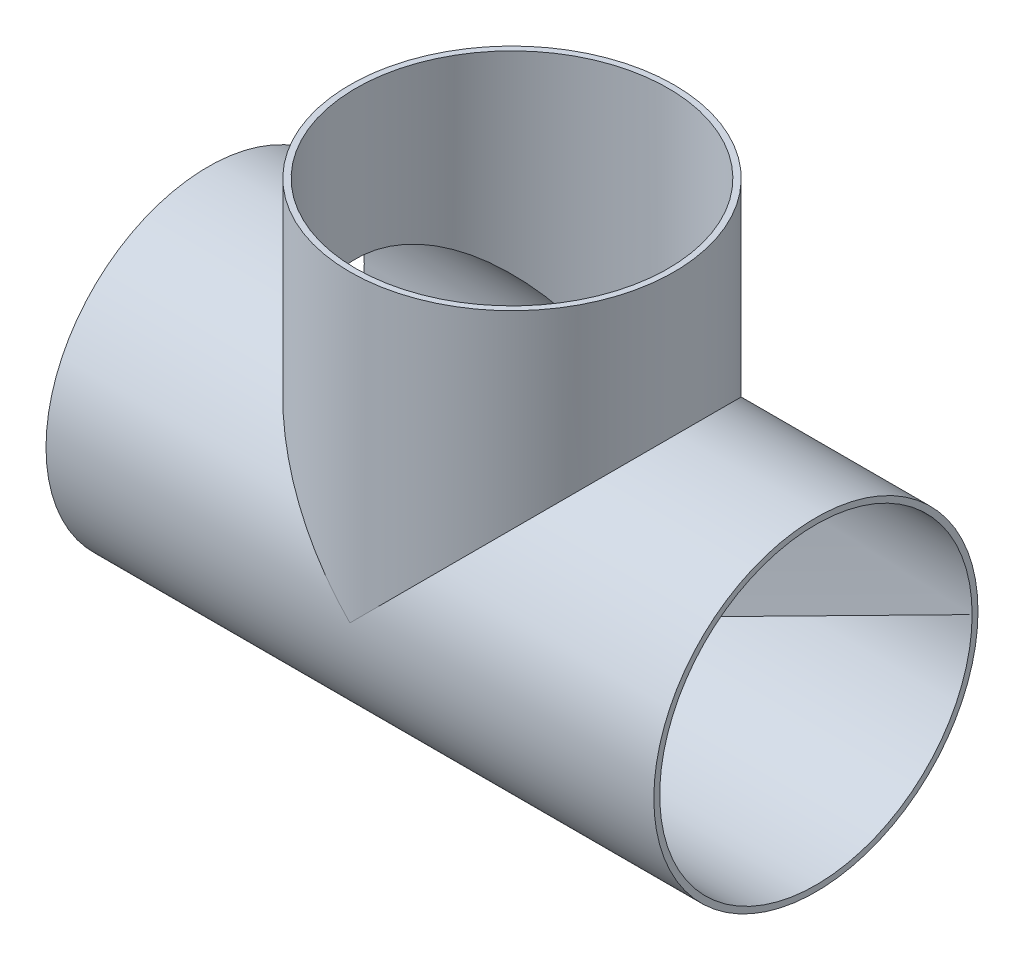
ISO-10303-21;
HEADER;
FILE_DESCRIPTION(('STEP AP214'),'2;1');
FILE_NAME('part.step','',(''),(''),'','','');
FILE_SCHEMA(('AUTOMOTIVE_DESIGN { 1 0 10303 214 1 1 1 1 }'));
ENDSEC;
DATA;
#1=APPLICATION_CONTEXT('core data for automotive mechanical design processes');
#2=APPLICATION_PROTOCOL_DEFINITION('international standard','automotive_design',2000,#1);
#3=PRODUCT_CONTEXT('',#1,'mechanical');
#4=PRODUCT('Part','Part','',(#3));
#5=PRODUCT_RELATED_PRODUCT_CATEGORY('part','',(#4));
#6=PRODUCT_DEFINITION_FORMATION('','',#4);
#7=PRODUCT_DEFINITION_CONTEXT('part definition',#1,'design');
#8=PRODUCT_DEFINITION('design','',#6,#7);
#9=PRODUCT_DEFINITION_SHAPE('','',#8);
#10=(LENGTH_UNIT() NAMED_UNIT(*) SI_UNIT(.MILLI.,.METRE.));
#11=(NAMED_UNIT(*) PLANE_ANGLE_UNIT() SI_UNIT($,.RADIAN.));
#12=(NAMED_UNIT(*) SI_UNIT($,.STERADIAN.) SOLID_ANGLE_UNIT());
#13=UNCERTAINTY_MEASURE_WITH_UNIT(LENGTH_MEASURE(1.E-05),#10,'distance_accuracy_value','');
#14=(GEOMETRIC_REPRESENTATION_CONTEXT(3) GLOBAL_UNCERTAINTY_ASSIGNED_CONTEXT((#13)) GLOBAL_UNIT_ASSIGNED_CONTEXT((#10,
#11,#12)) REPRESENTATION_CONTEXT('',''));
#15=CARTESIAN_POINT('',(0.,0.,0.));
#16=DIRECTION('',(0.,0.,1.));
#17=DIRECTION('',(1.,0.,0.));
#18=AXIS2_PLACEMENT_3D('',#15,#16,#17);
#19=CARTESIAN_POINT('',(0.,142.875,0.));
#20=DIRECTION('',(0.,1.,0.));
#21=DIRECTION('',(0.,0.,1.));
#22=AXIS2_PLACEMENT_3D('',#19,#20,#21);
#23=PLANE('',#22);
#24=CARTESIAN_POINT('',(0.,142.875,0.));
#25=DIRECTION('',(0.,1.,0.));
#26=DIRECTION('',(0.,0.,1.));
#27=AXIS2_PLACEMENT_3D('',#24,#25,#26);
#28=CIRCLE('',#27,76.2);
#29=CARTESIAN_POINT('',(0.,142.875,76.2));
#30=VERTEX_POINT('',#29);
#31=EDGE_CURVE('E68',#30,#30,#28,.T.);
#32=ORIENTED_EDGE('',*,*,#31,.T.);
#33=EDGE_LOOP('',(#32));
#34=FACE_BOUND('',#33,.T.);
#35=CARTESIAN_POINT('',(0.,142.875,0.));
#36=DIRECTION('',(0.,1.,0.));
#37=DIRECTION('',(0.,0.,1.));
#38=AXIS2_PLACEMENT_3D('',#35,#36,#37);
#39=CIRCLE('',#38,73.4314);
#40=CARTESIAN_POINT('',(0.,142.875,73.4314));
#41=VERTEX_POINT('',#40);
#42=EDGE_CURVE('E65',#41,#41,#39,.T.);
#43=ORIENTED_EDGE('',*,*,#42,.F.);
#44=EDGE_LOOP('',(#43));
#45=FACE_BOUND('',#44,.T.);
#46=ADVANCED_FACE('F33',(#34,#45),#23,.T.);
#47=CARTESIAN_POINT('',(142.875,0.,0.));
#48=DIRECTION('',(-1.,0.,0.));
#49=DIRECTION('',(0.,0.,1.));
#50=AXIS2_PLACEMENT_3D('',#47,#48,#49);
#51=CYLINDRICAL_SURFACE('',#50,76.2);
#52=CARTESIAN_POINT('',(-142.875,0.,0.));
#53=DIRECTION('',(1.,0.,0.));
#54=DIRECTION('',(0.,0.,-1.));
#55=AXIS2_PLACEMENT_3D('',#52,#53,#54);
#56=CIRCLE('',#55,76.2);
#57=CARTESIAN_POINT('',(-142.875,0.,-76.2));
#58=VERTEX_POINT('',#57);
#59=EDGE_CURVE('E74',#58,#58,#56,.T.);
#60=ORIENTED_EDGE('',*,*,#59,.T.);
#61=EDGE_LOOP('',(#60));
#62=FACE_BOUND('',#61,.T.);
#63=CARTESIAN_POINT('',(142.875,0.,0.));
#64=DIRECTION('',(1.,0.,0.));
#65=DIRECTION('',(0.,0.,-1.));
#66=AXIS2_PLACEMENT_3D('',#63,#64,#65);
#67=CIRCLE('',#66,76.2);
#68=CARTESIAN_POINT('',(142.875,0.,-76.2));
#69=VERTEX_POINT('',#68);
#70=EDGE_CURVE('E75',#69,#69,#67,.T.);
#71=ORIENTED_EDGE('',*,*,#70,.F.);
#72=EDGE_LOOP('',(#71));
#73=FACE_BOUND('',#72,.T.);
#74=CARTESIAN_POINT('',(0.,0.,0.));
#75=DIRECTION('',(-0.707106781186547,-0.707106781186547,0.));
#76=DIRECTION('',(-0.707106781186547,0.707106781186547,0.));
#77=AXIS2_PLACEMENT_3D('',#74,#75,#76);
#78=ELLIPSE('',#77,107.76307345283,76.2);
#79=CARTESIAN_POINT('',(0.,0.,-76.2));
#80=VERTEX_POINT('',#79);
#81=CARTESIAN_POINT('',(0.,0.,76.2));
#82=VERTEX_POINT('',#81);
#83=EDGE_CURVE('E11',#80,#82,#78,.F.);
#84=ORIENTED_EDGE('',*,*,#83,.F.);
#85=CARTESIAN_POINT('',(0.,0.,0.));
#86=DIRECTION('',(-0.707106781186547,0.707106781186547,0.));
#87=DIRECTION('',(-0.707106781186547,-0.707106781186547,0.));
#88=AXIS2_PLACEMENT_3D('',#85,#86,#87);
#89=ELLIPSE('',#88,107.76307345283,76.2);
#90=EDGE_CURVE('E41',#82,#80,#89,.T.);
#91=ORIENTED_EDGE('',*,*,#90,.F.);
#92=EDGE_LOOP('',(#84,#91));
#93=FACE_BOUND('',#92,.T.);
#94=ADVANCED_FACE('F35',(#62,#73,#93),#51,.T.);
#95=CARTESIAN_POINT('',(142.875,0.,0.));
#96=DIRECTION('',(1.,0.,0.));
#97=DIRECTION('',(0.,0.,-1.));
#98=AXIS2_PLACEMENT_3D('',#95,#96,#97);
#99=PLANE('',#98);
#100=CARTESIAN_POINT('',(142.875,0.,0.));
#101=DIRECTION('',(1.,0.,0.));
#102=DIRECTION('',(0.,0.,-1.));
#103=AXIS2_PLACEMENT_3D('',#100,#101,#102);
#104=CIRCLE('',#103,73.4314);
#105=CARTESIAN_POINT('',(142.875,0.,-73.4314));
#106=VERTEX_POINT('',#105);
#107=EDGE_CURVE('E149',#106,#106,#104,.T.);
#108=ORIENTED_EDGE('',*,*,#107,.F.);
#109=EDGE_LOOP('',(#108));
#110=FACE_BOUND('',#109,.T.);
#111=ORIENTED_EDGE('',*,*,#70,.T.);
#112=EDGE_LOOP('',(#111));
#113=FACE_BOUND('',#112,.T.);
#114=ADVANCED_FACE('F82',(#110,#113),#99,.T.);
#115=CARTESIAN_POINT('',(-142.875,0.,0.));
#116=DIRECTION('',(1.,0.,0.));
#117=DIRECTION('',(0.,0.,-1.));
#118=AXIS2_PLACEMENT_3D('',#115,#116,#117);
#119=PLANE('',#118);
#120=CARTESIAN_POINT('',(-142.875,0.,0.));
#121=DIRECTION('',(1.,0.,0.));
#122=DIRECTION('',(0.,0.,-1.));
#123=AXIS2_PLACEMENT_3D('',#120,#121,#122);
#124=CIRCLE('',#123,73.4314);
#125=CARTESIAN_POINT('',(-142.875,0.,-73.4314));
#126=VERTEX_POINT('',#125);
#127=EDGE_CURVE('E61',#126,#126,#124,.T.);
#128=ORIENTED_EDGE('',*,*,#127,.T.);
#129=EDGE_LOOP('',(#128));
#130=FACE_BOUND('',#129,.T.);
#131=ORIENTED_EDGE('',*,*,#59,.F.);
#132=EDGE_LOOP('',(#131));
#133=FACE_BOUND('',#132,.T.);
#134=ADVANCED_FACE('F88',(#130,#133),#119,.F.);
#135=CARTESIAN_POINT('',(0.,142.875,0.));
#136=DIRECTION('',(0.,-1.,0.));
#137=DIRECTION('',(0.,0.,-1.));
#138=AXIS2_PLACEMENT_3D('',#135,#136,#137);
#139=CYLINDRICAL_SURFACE('',#138,76.2);
#140=ORIENTED_EDGE('',*,*,#31,.F.);
#141=EDGE_LOOP('',(#140));
#142=FACE_BOUND('',#141,.T.);
#143=ORIENTED_EDGE('',*,*,#90,.T.);
#144=ORIENTED_EDGE('',*,*,#83,.T.);
#145=EDGE_LOOP('',(#143,#144));
#146=FACE_BOUND('',#145,.T.);
#147=ADVANCED_FACE('F80',(#142,#146),#139,.T.);
#148=CARTESIAN_POINT('',(0.,142.875,0.));
#149=DIRECTION('',(0.,-1.,0.));
#150=DIRECTION('',(0.,0.,-1.));
#151=AXIS2_PLACEMENT_3D('',#148,#149,#150);
#152=CYLINDRICAL_SURFACE('',#151,73.4314);
#153=CARTESIAN_POINT('',(0.,0.,0.));
#154=DIRECTION('',(0.707106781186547,-0.707106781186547,0.));
#155=DIRECTION('',(-0.707106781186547,-0.707106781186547,0.));
#156=AXIS2_PLACEMENT_3D('',#153,#154,#155);
#157=ELLIPSE('',#156,103.847681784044,73.4314);
#158=CARTESIAN_POINT('',(0.,0.,73.4314));
#159=VERTEX_POINT('',#158);
#160=CARTESIAN_POINT('',(0.,0.,-73.4314));
#161=VERTEX_POINT('',#160);
#162=EDGE_CURVE('E47',#159,#161,#157,.F.);
#163=ORIENTED_EDGE('',*,*,#162,.F.);
#164=CARTESIAN_POINT('',(0.,0.,0.));
#165=DIRECTION('',(-0.707106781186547,-0.707106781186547,0.));
#166=DIRECTION('',(0.707106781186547,-0.707106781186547,0.));
#167=AXIS2_PLACEMENT_3D('',#164,#165,#166);
#168=ELLIPSE('',#167,103.847681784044,73.4314);
#169=EDGE_CURVE('E57',#161,#159,#168,.F.);
#170=ORIENTED_EDGE('',*,*,#169,.F.);
#171=EDGE_LOOP('',(#163,#170));
#172=FACE_BOUND('',#171,.T.);
#173=ORIENTED_EDGE('',*,*,#42,.T.);
#174=EDGE_LOOP('',(#173));
#175=FACE_BOUND('',#174,.T.);
#176=ADVANCED_FACE('F63',(#172,#175),#152,.F.);
#177=CARTESIAN_POINT('',(-142.875,0.,0.));
#178=DIRECTION('',(1.,0.,0.));
#179=DIRECTION('',(0.,0.,-1.));
#180=AXIS2_PLACEMENT_3D('',#177,#178,#179);
#181=CYLINDRICAL_SURFACE('',#180,73.4314);
#182=ORIENTED_EDGE('',*,*,#162,.T.);
#183=ORIENTED_EDGE('',*,*,#169,.T.);
#184=EDGE_LOOP('',(#182,#183));
#185=FACE_BOUND('',#184,.T.);
#186=ORIENTED_EDGE('',*,*,#127,.F.);
#187=EDGE_LOOP('',(#186));
#188=FACE_BOUND('',#187,.T.);
#189=ORIENTED_EDGE('',*,*,#107,.T.);
#190=EDGE_LOOP('',(#189));
#191=FACE_BOUND('',#190,.T.);
#192=ADVANCED_FACE('F58',(#185,#188,#191),#181,.F.);
#193=CLOSED_SHELL('',(#46,#94,#114,#134,#147,#176,#192));
#194=MANIFOLD_SOLID_BREP('B2',#193);
#195=ADVANCED_BREP_SHAPE_REPRESENTATION('',(#18,#194),#14);
#196=SHAPE_DEFINITION_REPRESENTATION(#9,#195);
ENDSEC;
END-ISO-10303-21;
